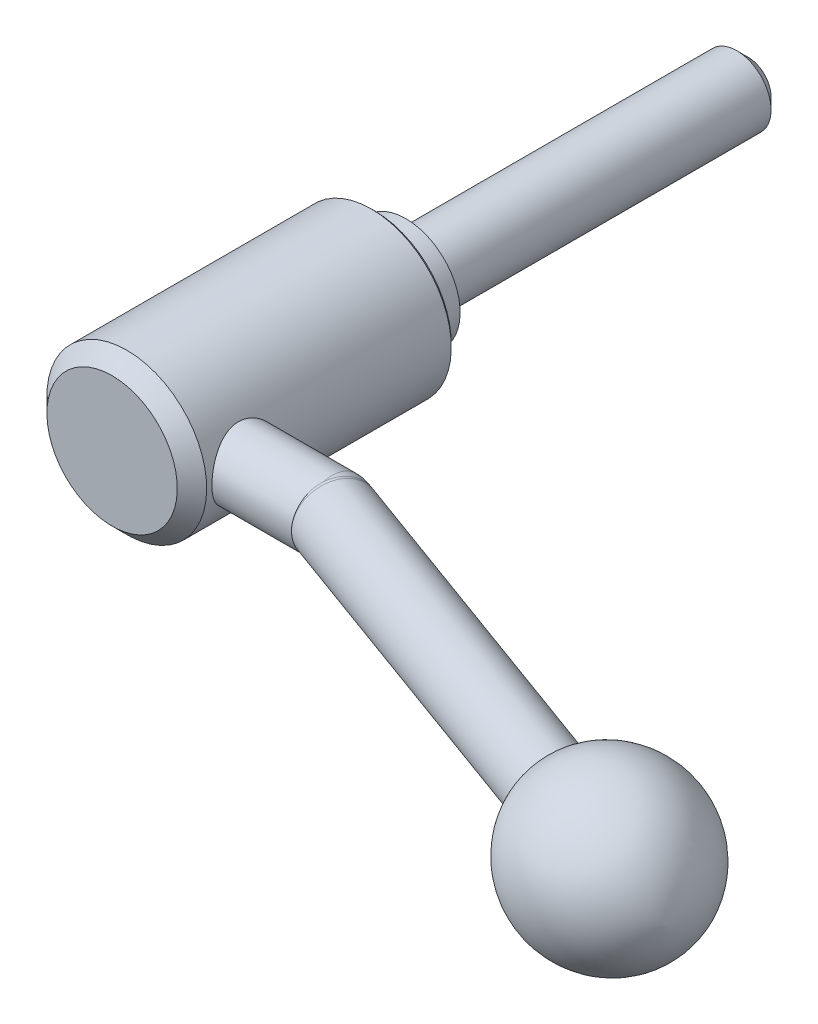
ISO-10303-21;
HEADER;
FILE_DESCRIPTION(('STEP AP214'),'2;1');
FILE_NAME('part.step','',(''),(''),'','','');
FILE_SCHEMA(('AUTOMOTIVE_DESIGN { 1 0 10303 214 1 1 1 1 }'));
ENDSEC;
DATA;
#1=APPLICATION_CONTEXT('core data for automotive mechanical design processes');
#2=APPLICATION_PROTOCOL_DEFINITION('international standard','automotive_design',2000,#1);
#3=PRODUCT_CONTEXT('',#1,'mechanical');
#4=PRODUCT('Part','Part','',(#3));
#5=PRODUCT_RELATED_PRODUCT_CATEGORY('part','',(#4));
#6=PRODUCT_DEFINITION_FORMATION('','',#4);
#7=PRODUCT_DEFINITION_CONTEXT('part definition',#1,'design');
#8=PRODUCT_DEFINITION('design','',#6,#7);
#9=PRODUCT_DEFINITION_SHAPE('','',#8);
#10=(LENGTH_UNIT() NAMED_UNIT(*) SI_UNIT(.MILLI.,.METRE.));
#11=(NAMED_UNIT(*) PLANE_ANGLE_UNIT() SI_UNIT($,.RADIAN.));
#12=(NAMED_UNIT(*) SI_UNIT($,.STERADIAN.) SOLID_ANGLE_UNIT());
#13=UNCERTAINTY_MEASURE_WITH_UNIT(LENGTH_MEASURE(1.E-05),#10,'distance_accuracy_value','');
#14=(GEOMETRIC_REPRESENTATION_CONTEXT(3) GLOBAL_UNCERTAINTY_ASSIGNED_CONTEXT((#13)) GLOBAL_UNIT_ASSIGNED_CONTEXT((#10,
#11,#12)) REPRESENTATION_CONTEXT('',''));
#15=CARTESIAN_POINT('',(0.,0.,0.));
#16=DIRECTION('',(0.,0.,1.));
#17=DIRECTION('',(1.,0.,0.));
#18=AXIS2_PLACEMENT_3D('',#15,#16,#17);
#19=CARTESIAN_POINT('',(0.,0.,0.));
#20=DIRECTION('',(0.,0.,-1.));
#21=DIRECTION('',(0.,1.,0.));
#22=AXIS2_PLACEMENT_3D('',#19,#20,#21);
#23=CYLINDRICAL_SURFACE('',#22,14.);
#24=CARTESIAN_POINT('',(0.,0.,6.05));
#25=DIRECTION('',(0.,0.,-1.));
#26=DIRECTION('',(0.,1.,0.));
#27=AXIS2_PLACEMENT_3D('',#24,#25,#26);
#28=CIRCLE('',#27,14.);
#29=CARTESIAN_POINT('',(0.,14.,6.05));
#30=VERTEX_POINT('',#29);
#31=EDGE_CURVE('E160',#30,#30,#28,.T.);
#32=ORIENTED_EDGE('',*,*,#31,.F.);
#33=EDGE_LOOP('',(#32));
#34=FACE_BOUND('',#33,.T.);
#35=CARTESIAN_POINT('',(12.6491106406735,6.,42.));
#36=CARTESIAN_POINT('',(12.6491119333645,5.99999879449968,42.1596004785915));
#37=CARTESIAN_POINT('',(12.6521417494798,5.99362272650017,42.319252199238));
#38=CARTESIAN_POINT('',(12.6641604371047,5.96818497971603,42.6373858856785));
#39=CARTESIAN_POINT('',(12.6731530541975,5.9491153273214,42.7958670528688));
#40=CARTESIAN_POINT('',(12.6968113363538,5.89845433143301,43.1107250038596));
#41=CARTESIAN_POINT('',(12.7114886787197,5.86683721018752,43.2670967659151));
#42=CARTESIAN_POINT('',(12.7460281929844,5.79141457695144,43.5763457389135));
#43=CARTESIAN_POINT('',(12.7658925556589,5.74760391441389,43.7292214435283));
#44=CARTESIAN_POINT('',(12.8100655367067,5.64846416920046,44.029718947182));
#45=CARTESIAN_POINT('',(12.834352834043,5.59319017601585,44.177362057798));
#46=CARTESIAN_POINT('',(12.8867070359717,5.47148691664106,44.467303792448));
#47=CARTESIAN_POINT('',(12.9147753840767,5.40505338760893,44.6096003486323));
#48=CARTESIAN_POINT('',(13.0034453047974,5.18984372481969,45.0271066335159));
#49=CARTESIAN_POINT('',(13.0685687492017,5.02503655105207,45.2932994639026));
#50=CARTESIAN_POINT('',(13.2082270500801,4.64606142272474,45.8109410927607));
#51=CARTESIAN_POINT('',(13.2830918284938,4.42953098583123,46.0605561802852));
#52=CARTESIAN_POINT('',(13.4311425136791,3.95794082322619,46.5214200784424));
#53=CARTESIAN_POINT('',(13.5043277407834,3.70286580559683,46.7326535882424));
#54=CARTESIAN_POINT('',(13.6088499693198,3.28949768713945,47.0208851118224));
#55=CARTESIAN_POINT('',(13.6435186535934,3.14296205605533,47.11390422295));
#56=CARTESIAN_POINT('',(13.7094062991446,2.84181000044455,47.2871776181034));
#57=CARTESIAN_POINT('',(13.7406265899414,2.68719672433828,47.3674368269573));
#58=CARTESIAN_POINT('',(13.798716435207,2.37092404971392,47.5144478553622));
#59=CARTESIAN_POINT('',(13.8255866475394,2.2092657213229,47.5812017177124));
#60=CARTESIAN_POINT('',(13.8741880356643,1.88004748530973,47.7005320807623));
#61=CARTESIAN_POINT('',(13.895919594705,1.71248801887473,47.7531096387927));
#62=CARTESIAN_POINT('',(13.9325503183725,1.38207962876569,47.8410157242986));
#63=CARTESIAN_POINT('',(13.9477579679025,1.21947370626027,47.8771298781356));
#64=CARTESIAN_POINT('',(13.9725603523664,0.891408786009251,47.9357518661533));
#65=CARTESIAN_POINT('',(13.9821554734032,0.725949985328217,47.9582606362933));
#66=CARTESIAN_POINT('',(13.9954554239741,0.393553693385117,47.9894048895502));
#67=CARTESIAN_POINT('',(13.9991623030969,0.226616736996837,47.9980452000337));
#68=CARTESIAN_POINT('',(14.0005839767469,-0.107418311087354,48.0013627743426));
#69=CARTESIAN_POINT('',(13.9982990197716,-0.274516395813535,47.996040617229));
#70=CARTESIAN_POINT('',(13.9881447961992,-0.596733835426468,47.9722942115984));
#71=CARTESIAN_POINT('',(13.9806457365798,-0.751929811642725,47.9547383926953));
#72=CARTESIAN_POINT('',(13.9606520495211,-1.06021754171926,47.9076442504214));
#73=CARTESIAN_POINT('',(13.9481558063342,-1.21330859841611,47.8781020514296));
#74=CARTESIAN_POINT('',(13.9184825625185,-1.51624558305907,47.807339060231));
#75=CARTESIAN_POINT('',(13.9013071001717,-1.66609256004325,47.7661221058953));
#76=CARTESIAN_POINT('',(13.8626834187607,-1.96169333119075,47.6723729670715));
#77=CARTESIAN_POINT('',(13.8412335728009,-2.10744554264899,47.6198364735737));
#78=CARTESIAN_POINT('',(13.7942200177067,-2.39607632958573,47.5030361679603));
#79=CARTESIAN_POINT('',(13.7685998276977,-2.53887984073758,47.4386094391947));
#80=CARTESIAN_POINT('',(13.7140859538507,-2.81854325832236,47.2990820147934));
#81=CARTESIAN_POINT('',(13.6851910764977,-2.9554009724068,47.2239774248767));
#82=CARTESIAN_POINT('',(13.5945766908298,-3.35592063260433,46.9834369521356));
#83=CARTESIAN_POINT('',(13.5288965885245,-3.60971063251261,46.8027004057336));
#84=CARTESIAN_POINT('',(13.3878711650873,-4.10313412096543,46.3903719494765));
#85=CARTESIAN_POINT('',(13.3121702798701,-4.34033236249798,46.1560074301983));
#86=CARTESIAN_POINT('',(13.1631451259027,-4.77326595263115,45.6505491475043));
#87=CARTESIAN_POINT('',(13.0898218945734,-4.96898340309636,45.3794396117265));
#88=CARTESIAN_POINT('',(12.9865629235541,-5.2305288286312,44.9447706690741));
#89=CARTESIAN_POINT('',(12.9527260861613,-5.31354333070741,44.7922272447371));
#90=CARTESIAN_POINT('',(12.8890027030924,-5.46630143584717,44.4798640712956));
#91=CARTESIAN_POINT('',(12.8591145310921,-5.53605050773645,44.3200473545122));
#92=CARTESIAN_POINT('',(12.8043472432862,-5.66157110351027,43.9942625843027));
#93=CARTESIAN_POINT('',(12.7794661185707,-5.7173482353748,43.8282970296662));
#94=CARTESIAN_POINT('',(12.7356345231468,-5.81433157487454,43.4913958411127));
#95=CARTESIAN_POINT('',(12.7166834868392,-5.85553917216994,43.3204606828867));
#96=CARTESIAN_POINT('',(12.6865220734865,-5.9205872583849,42.9866991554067));
#97=CARTESIAN_POINT('',(12.6748757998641,-5.94541170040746,42.824103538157));
#98=CARTESIAN_POINT('',(12.6578221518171,-5.98163380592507,42.4971025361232));
#99=CARTESIAN_POINT('',(12.6524143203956,-5.99303245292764,42.3326972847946));
#100=CARTESIAN_POINT('',(12.6480404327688,-6.00225784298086,42.0034733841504));
#101=CARTESIAN_POINT('',(12.6490723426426,-6.00008887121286,41.8386548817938));
#102=CARTESIAN_POINT('',(12.6575345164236,-5.98221680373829,41.5099230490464));
#103=CARTESIAN_POINT('',(12.6649645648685,-5.96651416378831,41.3460096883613));
#104=CARTESIAN_POINT('',(12.685211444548,-5.92333782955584,41.0317850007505));
#105=CARTESIAN_POINT('',(12.6976163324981,-5.89676170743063,40.8813224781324));
#106=CARTESIAN_POINT('',(12.7273370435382,-5.83233654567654,40.5832773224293));
#107=CARTESIAN_POINT('',(12.7446544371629,-5.79448390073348,40.435695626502));
#108=CARTESIAN_POINT('',(12.7836779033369,-5.70787446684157,40.1443991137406));
#109=CARTESIAN_POINT('',(12.8053831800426,-5.65911965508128,40.0006836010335));
#110=CARTESIAN_POINT('',(12.8525781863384,-5.55109972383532,39.7178468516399));
#111=CARTESIAN_POINT('',(12.8780693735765,-5.49183055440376,39.5787274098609));
#112=CARTESIAN_POINT('',(12.9333207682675,-5.36045709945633,39.2999549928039));
#113=CARTESIAN_POINT('',(12.9632176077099,-5.28790975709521,39.160537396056));
#114=CARTESIAN_POINT('',(13.0255703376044,-5.13240219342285,38.8882359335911));
#115=CARTESIAN_POINT('',(13.0580270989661,-5.04943842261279,38.7553543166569));
#116=CARTESIAN_POINT('',(13.1580121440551,-4.78560208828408,38.3674196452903));
#117=CARTESIAN_POINT('',(13.2281845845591,-4.58971750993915,38.1229353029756));
#118=CARTESIAN_POINT('',(13.3366249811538,-4.26021445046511,37.7715869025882));
#119=CARTESIAN_POINT('',(13.3748529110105,-4.13892354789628,37.6527973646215));
#120=CARTESIAN_POINT('',(13.4503551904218,-3.88654904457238,37.4257795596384));
#121=CARTESIAN_POINT('',(13.4876298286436,-3.75546845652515,37.3175480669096));
#122=CARTESIAN_POINT('',(13.5602429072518,-3.48418488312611,37.1123202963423));
#123=CARTESIAN_POINT('',(13.5955803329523,-3.34397719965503,37.0153298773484));
#124=CARTESIAN_POINT('',(13.6633349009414,-3.05536185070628,36.8333913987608));
#125=CARTESIAN_POINT('',(13.6957533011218,-2.90695776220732,36.7484381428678));
#126=CARTESIAN_POINT('',(13.7569620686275,-2.60198219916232,36.5908122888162));
#127=CARTESIAN_POINT('',(13.78573175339,-2.44537070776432,36.5182089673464));
#128=CARTESIAN_POINT('',(13.8386034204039,-2.12585519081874,36.3865716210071));
#129=CARTESIAN_POINT('',(13.862707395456,-1.96295388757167,36.3275318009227));
#130=CARTESIAN_POINT('',(13.9055467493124,-1.63205123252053,36.2236281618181));
#131=CARTESIAN_POINT('',(13.9242837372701,-1.46405142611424,36.1787600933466));
#132=CARTESIAN_POINT('',(13.9558282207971,-1.12426022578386,36.1037042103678));
#133=CARTESIAN_POINT('',(13.9686361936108,-0.952469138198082,36.0735152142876));
#134=CARTESIAN_POINT('',(13.9872197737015,-0.619242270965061,36.0298514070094));
#135=CARTESIAN_POINT('',(13.9934418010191,-0.457969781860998,36.0153142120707));
#136=CARTESIAN_POINT('',(14.0002858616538,-0.134661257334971,35.9993285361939));
#137=CARTESIAN_POINT('',(14.0009081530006,0.0273747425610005,35.99787945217));
#138=CARTESIAN_POINT('',(13.9965361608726,0.350926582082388,36.008085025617));
#139=CARTESIAN_POINT('',(13.991542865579,0.512442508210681,36.0197373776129));
#140=CARTESIAN_POINT('',(13.976077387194,0.833743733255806,36.0560107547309));
#141=CARTESIAN_POINT('',(13.9656052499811,0.993529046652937,36.0806316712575));
#142=CARTESIAN_POINT('',(13.9399800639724,1.30393627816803,36.1413509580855));
#143=CARTESIAN_POINT('',(13.9250277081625,1.45467118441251,36.176958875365));
#144=CARTESIAN_POINT('',(13.89068609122,1.75251852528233,36.2595669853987));
#145=CARTESIAN_POINT('',(13.8712953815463,1.89962975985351,36.3065708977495));
#146=CARTESIAN_POINT('',(13.8285434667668,2.18924878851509,36.4115377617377));
#147=CARTESIAN_POINT('',(13.8051831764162,2.33175763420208,36.4694981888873));
#148=CARTESIAN_POINT('',(13.7550167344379,2.61145800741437,36.5959410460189));
#149=CARTESIAN_POINT('',(13.7282092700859,2.74864748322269,36.6644274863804));
#150=CARTESIAN_POINT('',(13.6704759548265,3.02301487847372,36.8147378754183));
#151=CARTESIAN_POINT('',(13.639418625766,3.1599112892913,36.8970251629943));
#152=CARTESIAN_POINT('',(13.5749315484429,3.42637329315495,37.0719801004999));
#153=CARTESIAN_POINT('',(13.5415009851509,3.55593634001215,37.1646513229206));
#154=CARTESIAN_POINT('',(13.4730570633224,3.80705581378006,37.3597829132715));
#155=CARTESIAN_POINT('',(13.4380434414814,3.9286109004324,37.4622449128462));
#156=CARTESIAN_POINT('',(13.3672591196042,4.16309810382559,37.6763643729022));
#157=CARTESIAN_POINT('',(13.3314883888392,4.27602986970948,37.7880222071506));
#158=CARTESIAN_POINT('',(13.257431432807,4.50061025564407,38.02841367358));
#159=CARTESIAN_POINT('',(13.2191519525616,4.61156500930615,38.1577987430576));
#160=CARTESIAN_POINT('',(13.1437838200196,4.82218384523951,38.4257073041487));
#161=CARTESIAN_POINT('',(13.1066947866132,4.92185156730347,38.5642278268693));
#162=CARTESIAN_POINT('',(13.0347422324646,5.10936324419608,38.8498227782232));
#163=CARTESIAN_POINT('',(12.9998810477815,5.19719489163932,38.9969058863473));
#164=CARTESIAN_POINT('',(12.9335248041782,5.36019403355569,39.2985749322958));
#165=CARTESIAN_POINT('',(12.9020282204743,5.43536727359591,39.4531574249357));
#166=CARTESIAN_POINT('',(12.8434648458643,5.57233851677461,39.7687244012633));
#167=CARTESIAN_POINT('',(12.8163926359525,5.63415291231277,39.9297007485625));
#168=CARTESIAN_POINT('',(12.7676047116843,5.74385568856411,40.2570433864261));
#169=CARTESIAN_POINT('',(12.7458863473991,5.79175096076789,40.4234069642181));
#170=CARTESIAN_POINT('',(12.7086612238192,5.87298255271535,40.7598587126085));
#171=CARTESIAN_POINT('',(12.6931381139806,5.90635721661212,40.9299358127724));
#172=CARTESIAN_POINT('',(12.6688496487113,5.95827833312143,41.2727263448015));
#173=CARTESIAN_POINT('',(12.6600791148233,5.97683614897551,41.4454376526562));
#174=CARTESIAN_POINT('',(12.6529445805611,5.99191158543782,41.6821226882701));
#175=CARTESIAN_POINT('',(12.6515079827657,5.99494373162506,41.7456483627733));
#176=CARTESIAN_POINT('',(12.6495907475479,5.998988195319,41.8727799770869));
#177=CARTESIAN_POINT('',(12.6491101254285,6.00000048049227,41.936385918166));
#178=CARTESIAN_POINT('',(12.6491106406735,6.,42.));
#179=B_SPLINE_CURVE_WITH_KNOTS('',3,(#35,#36,#37,#38,#39,#40,#41,#42,#43,#44,#45,#46,#47,#48,
#49,#50,#51,#52,#53,#54,#55,#56,#57,#58,#59,#60,#61,#62,#63,#64,#65,#66,#67,#68,#69,#70,#71,#72,
#73,#74,#75,#76,#77,#78,#79,#80,#81,#82,#83,#84,#85,#86,#87,#88,#89,#90,#91,#92,#93,#94,#95,#96,
#97,#98,#99,#100,#101,#102,#103,#104,#105,#106,#107,#108,#109,#110,#111,#112,#113,#114,#115,
#116,#117,#118,#119,#120,#121,#122,#123,#124,#125,#126,#127,#128,#129,#130,#131,#132,#133,#134,
#135,#136,#137,#138,#139,#140,#141,#142,#143,#144,#145,#146,#147,#148,#149,#150,#151,#152,#153,
#154,#155,#156,#157,#158,#159,#160,#161,#162,#163,#164,#165,#166,#167,#168,#169,#170,#171,#172,
#173,#174,#175,#176,#177,#178),.UNSPECIFIED.,.T.,.F.,(4,2,2,2,2,2,2,2,2,2,2,2,2,2,2,2,2,2,2,2,2,
2,2,2,2,2,2,2,2,2,2,2,2,2,2,2,2,2,2,2,2,2,2,2,2,2,2,2,2,2,2,2,2,2,2,2,2,2,2,2,2,2,2,2,2,2,2,2,2,
2,2,4),(0.,0.478735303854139,0.957771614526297,1.43779720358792,1.91802586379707,
2.39599804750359,2.87415322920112,3.82930565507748,4.84157827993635,5.85425356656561,
6.38467511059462,6.91489143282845,7.44502749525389,7.97512400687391,8.47625092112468,
8.9773433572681,9.47826133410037,9.97915853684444,10.4477041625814,10.9164014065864,
11.3849447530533,11.8536667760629,12.3293655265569,12.8052382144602,13.756394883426,
14.7778987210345,15.7998424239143,16.330075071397,16.8600886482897,17.3898891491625,
17.9196391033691,18.4136567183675,18.9076381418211,19.4014635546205,19.8952723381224,
20.354632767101,20.814140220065,21.2735644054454,21.7331659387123,22.2125740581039,
22.6921459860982,23.6508169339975,24.1724207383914,24.6938646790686,25.2155791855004,
25.7370677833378,26.2613915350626,26.7854908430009,27.3094328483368,27.8333326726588,
28.3188546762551,28.8043543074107,29.2897685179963,29.7751786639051,30.2414628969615,
30.7078995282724,31.1742288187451,31.6407362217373,32.1283561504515,32.6161443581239,
33.1040139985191,33.5919034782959,34.1153644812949,34.6386561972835,35.1624879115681,
35.6860812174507,36.2090283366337,36.7317160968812,37.253015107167,37.7739139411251,
37.9647267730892,38.1555426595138),.UNSPECIFIED.);
#180=CARTESIAN_POINT('',(12.6491106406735,6.,42.));
#181=VERTEX_POINT('',#180);
#182=EDGE_CURVE('E79',#181,#181,#179,.T.);
#183=ORIENTED_EDGE('',*,*,#182,.F.);
#184=EDGE_LOOP('',(#183));
#185=FACE_BOUND('',#184,.T.);
#186=CARTESIAN_POINT('',(0.,0.,48.925));
#187=DIRECTION('',(0.,0.,-1.));
#188=DIRECTION('',(0.,1.,0.));
#189=AXIS2_PLACEMENT_3D('',#186,#187,#188);
#190=CIRCLE('',#189,14.);
#191=CARTESIAN_POINT('',(0.,14.,48.925));
#192=VERTEX_POINT('',#191);
#193=EDGE_CURVE('E163',#192,#192,#190,.T.);
#194=ORIENTED_EDGE('',*,*,#193,.T.);
#195=EDGE_LOOP('',(#194));
#196=FACE_BOUND('',#195,.T.);
#197=ADVANCED_FACE('F15',(#34,#185,#196),#23,.T.);
#198=CARTESIAN_POINT('',(0.,0.,51.5));
#199=DIRECTION('',(0.,0.,-1.));
#200=DIRECTION('',(0.,1.,0.));
#201=AXIS2_PLACEMENT_3D('',#198,#199,#200);
#202=PLANE('',#201);
#203=CARTESIAN_POINT('',(0.,0.,51.5));
#204=DIRECTION('',(0.,0.,-1.));
#205=DIRECTION('',(0.,1.,0.));
#206=AXIS2_PLACEMENT_3D('',#203,#204,#205);
#207=CIRCLE('',#206,11.425);
#208=CARTESIAN_POINT('',(0.,11.425,51.5));
#209=VERTEX_POINT('',#208);
#210=EDGE_CURVE('E88',#209,#209,#207,.T.);
#211=ORIENTED_EDGE('',*,*,#210,.F.);
#212=EDGE_LOOP('',(#211));
#213=FACE_BOUND('',#212,.T.);
#214=ADVANCED_FACE('F63',(#213),#202,.F.);
#215=CARTESIAN_POINT('',(0.,0.,51.5));
#216=DIRECTION('',(0.,0.,-1.));
#217=DIRECTION('',(0.,1.,0.));
#218=AXIS2_PLACEMENT_3D('',#215,#216,#217);
#219=CONICAL_SURFACE('',#218,11.425,0.785398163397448);
#220=ORIENTED_EDGE('',*,*,#193,.F.);
#221=EDGE_LOOP('',(#220));
#222=FACE_BOUND('',#221,.T.);
#223=ORIENTED_EDGE('',*,*,#210,.T.);
#224=EDGE_LOOP('',(#223));
#225=FACE_BOUND('',#224,.T.);
#226=ADVANCED_FACE('F69',(#222,#225),#219,.T.);
#227=CARTESIAN_POINT('',(0.,0.,6.05));
#228=DIRECTION('',(0.,0.,1.));
#229=DIRECTION('',(0.,-1.,0.));
#230=AXIS2_PLACEMENT_3D('',#227,#228,#229);
#231=CONICAL_SURFACE('',#230,14.,0.785398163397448);
#232=CARTESIAN_POINT('',(0.,0.,5.5));
#233=DIRECTION('',(0.,0.,-1.));
#234=DIRECTION('',(0.,1.,0.));
#235=AXIS2_PLACEMENT_3D('',#232,#233,#234);
#236=CIRCLE('',#235,13.45);
#237=CARTESIAN_POINT('',(0.,13.45,5.5));
#238=VERTEX_POINT('',#237);
#239=EDGE_CURVE('E154',#238,#238,#236,.T.);
#240=ORIENTED_EDGE('',*,*,#239,.F.);
#241=EDGE_LOOP('',(#240));
#242=FACE_BOUND('',#241,.T.);
#243=ORIENTED_EDGE('',*,*,#31,.T.);
#244=EDGE_LOOP('',(#243));
#245=FACE_BOUND('',#244,.T.);
#246=ADVANCED_FACE('F76',(#242,#245),#231,.T.);
#247=CARTESIAN_POINT('',(13.45,0.,5.5));
#248=DIRECTION('',(0.,0.,1.));
#249=DIRECTION('',(0.,-1.,0.));
#250=AXIS2_PLACEMENT_3D('',#247,#248,#249);
#251=PLANE('',#250);
#252=CARTESIAN_POINT('',(0.,0.,5.5));
#253=DIRECTION('',(0.,0.,-1.));
#254=DIRECTION('',(0.,1.,0.));
#255=AXIS2_PLACEMENT_3D('',#252,#253,#254);
#256=CIRCLE('',#255,9.5);
#257=CARTESIAN_POINT('',(0.,9.5,5.5));
#258=VERTEX_POINT('',#257);
#259=EDGE_CURVE('E150',#258,#258,#256,.T.);
#260=ORIENTED_EDGE('',*,*,#259,.F.);
#261=EDGE_LOOP('',(#260));
#262=FACE_BOUND('',#261,.T.);
#263=ORIENTED_EDGE('',*,*,#239,.T.);
#264=EDGE_LOOP('',(#263));
#265=FACE_BOUND('',#264,.T.);
#266=ADVANCED_FACE('F177',(#262,#265),#251,.F.);
#267=CARTESIAN_POINT('',(0.,0.,0.));
#268=DIRECTION('',(0.,0.,-1.));
#269=DIRECTION('',(0.,1.,0.));
#270=AXIS2_PLACEMENT_3D('',#267,#268,#269);
#271=CYLINDRICAL_SURFACE('',#270,9.5);
#272=CARTESIAN_POINT('',(0.,0.,0.));
#273=DIRECTION('',(0.,0.,-1.));
#274=DIRECTION('',(0.,1.,0.));
#275=AXIS2_PLACEMENT_3D('',#272,#273,#274);
#276=CIRCLE('',#275,9.5);
#277=CARTESIAN_POINT('',(0.,9.5,0.));
#278=VERTEX_POINT('',#277);
#279=EDGE_CURVE('E147',#278,#278,#276,.T.);
#280=ORIENTED_EDGE('',*,*,#279,.F.);
#281=EDGE_LOOP('',(#280));
#282=FACE_BOUND('',#281,.T.);
#283=ORIENTED_EDGE('',*,*,#259,.T.);
#284=EDGE_LOOP('',(#283));
#285=FACE_BOUND('',#284,.T.);
#286=ADVANCED_FACE('F144',(#282,#285),#271,.T.);
#287=CARTESIAN_POINT('',(9.5,0.,0.));
#288=DIRECTION('',(0.,0.,1.));
#289=DIRECTION('',(0.,-1.,0.));
#290=AXIS2_PLACEMENT_3D('',#287,#288,#289);
#291=PLANE('',#290);
#292=CARTESIAN_POINT('',(0.,0.,0.));
#293=DIRECTION('',(0.,0.,-1.));
#294=DIRECTION('',(0.,1.,0.));
#295=AXIS2_PLACEMENT_3D('',#292,#293,#294);
#296=CIRCLE('',#295,6.);
#297=CARTESIAN_POINT('',(0.,6.,0.));
#298=VERTEX_POINT('',#297);
#299=EDGE_CURVE('E134',#298,#298,#296,.T.);
#300=ORIENTED_EDGE('',*,*,#299,.F.);
#301=EDGE_LOOP('',(#300));
#302=FACE_BOUND('',#301,.T.);
#303=ORIENTED_EDGE('',*,*,#279,.T.);
#304=EDGE_LOOP('',(#303));
#305=FACE_BOUND('',#304,.T.);
#306=ADVANCED_FACE('F96',(#302,#305),#291,.F.);
#307=CARTESIAN_POINT('',(35.,0.,42.));
#308=DIRECTION('',(1.,0.,0.));
#309=DIRECTION('',(0.,1.,0.));
#310=AXIS2_PLACEMENT_3D('',#307,#308,#309);
#311=CYLINDRICAL_SURFACE('',#310,6.);
#312=CARTESIAN_POINT('',(29.0002,-5.79737991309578,43.546087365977));
#313=CARTESIAN_POINT('',(28.9724990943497,-5.77707543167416,43.6222362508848));
#314=CARTESIAN_POINT('',(28.9459271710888,-5.75516638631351,43.6983487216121));
#315=CARTESIAN_POINT('',(28.894739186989,-5.70814835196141,43.8502306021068));
#316=CARTESIAN_POINT('',(28.8701228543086,-5.68303980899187,43.9260000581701));
#317=CARTESIAN_POINT('',(28.7987695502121,-5.6029491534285,44.1523368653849));
#318=CARTESIAN_POINT('',(28.7544982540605,-5.54317949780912,44.3020176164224));
#319=CARTESIAN_POINT('',(28.6711793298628,-5.41121602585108,44.5970862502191));
#320=CARTESIAN_POINT('',(28.6321268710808,-5.3390338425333,44.7424780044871));
#321=CARTESIAN_POINT('',(28.5583361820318,-5.18257721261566,45.0277646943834));
#322=CARTESIAN_POINT('',(28.5235982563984,-5.09830191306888,45.1676592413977));
#323=CARTESIAN_POINT('',(28.4579073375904,-4.91822874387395,45.4406017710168));
#324=CARTESIAN_POINT('',(28.4269515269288,-4.82243955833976,45.5736548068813));
#325=CARTESIAN_POINT('',(28.3684157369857,-4.61988344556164,45.8319198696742));
#326=CARTESIAN_POINT('',(28.3408357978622,-4.5131163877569,45.9571318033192));
#327=CARTESIAN_POINT('',(28.2887910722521,-4.28931411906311,46.1986769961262));
#328=CARTESIAN_POINT('',(28.264325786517,-4.17228055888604,46.3150116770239));
#329=CARTESIAN_POINT('',(28.2183149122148,-3.92870690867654,46.537897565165));
#330=CARTESIAN_POINT('',(28.1967693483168,-3.8021667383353,46.6444486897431));
#331=CARTESIAN_POINT('',(28.1562496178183,-3.53907309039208,46.8479799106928));
#332=CARTESIAN_POINT('',(28.1373045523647,-3.40242909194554,46.944848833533));
#333=CARTESIAN_POINT('',(28.1021430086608,-3.12121919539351,47.1269937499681));
#334=CARTESIAN_POINT('',(28.0859274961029,-2.97665051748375,47.212265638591));
#335=CARTESIAN_POINT('',(28.0561585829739,-2.68068805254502,47.3704807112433));
#336=CARTESIAN_POINT('',(28.0426047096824,-2.52929548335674,47.4434260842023));
#337=CARTESIAN_POINT('',(28.0180943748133,-2.2206886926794,47.5764491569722));
#338=CARTESIAN_POINT('',(28.0071388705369,-2.063472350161,47.6365221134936));
#339=CARTESIAN_POINT('',(27.987872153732,-1.74574860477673,47.7428380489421));
#340=CARTESIAN_POINT('',(27.97953948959,-1.5852799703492,47.7891930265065));
#341=CARTESIAN_POINT('',(27.965363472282,-1.26087148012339,47.8683977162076));
#342=CARTESIAN_POINT('',(27.9595210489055,-1.09693035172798,47.9012423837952));
#343=CARTESIAN_POINT('',(27.950314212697,-0.766902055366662,47.9531293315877));
#344=CARTESIAN_POINT('',(27.9469484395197,-0.600816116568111,47.972179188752));
#345=CARTESIAN_POINT('',(27.9426785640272,-0.267526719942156,47.9963621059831));
#346=CARTESIAN_POINT('',(27.9417755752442,-0.100322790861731,48.0014888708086));
#347=CARTESIAN_POINT('',(27.9424301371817,0.233076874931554,47.9977768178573));
#348=CARTESIAN_POINT('',(27.943975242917,0.399273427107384,47.9890086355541));
#349=CARTESIAN_POINT('',(27.9495060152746,0.730248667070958,47.9577139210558));
#350=CARTESIAN_POINT('',(27.9534905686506,0.895027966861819,47.9351936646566));
#351=CARTESIAN_POINT('',(27.9639138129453,1.22215531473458,47.8765604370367));
#352=CARTESIAN_POINT('',(27.9703537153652,1.38450212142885,47.8404407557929));
#353=CARTESIAN_POINT('',(27.9857050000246,1.70547020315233,47.7549062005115));
#354=CARTESIAN_POINT('',(27.9946154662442,1.86409283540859,47.7054962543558));
#355=CARTESIAN_POINT('',(28.0149428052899,2.17661167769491,47.5937385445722));
#356=CARTESIAN_POINT('',(28.0263605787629,2.33050616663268,47.5313861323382));
#357=CARTESIAN_POINT('',(28.0517386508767,2.63237333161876,47.3942638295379));
#358=CARTESIAN_POINT('',(28.0656980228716,2.78034814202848,47.3194984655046));
#359=CARTESIAN_POINT('',(28.0962237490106,3.06943625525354,47.1580977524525));
#360=CARTESIAN_POINT('',(28.1127906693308,3.21054805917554,47.0714598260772));
#361=CARTESIAN_POINT('',(28.1486024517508,3.48485557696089,46.8870325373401));
#362=CARTESIAN_POINT('',(28.1678464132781,3.61805393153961,46.789246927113));
#363=CARTESIAN_POINT('',(28.2092310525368,3.87634885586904,46.5827287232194));
#364=CARTESIAN_POINT('',(28.2313862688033,4.00139970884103,46.4739418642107));
#365=CARTESIAN_POINT('',(28.2786635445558,4.24179144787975,46.2467117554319));
#366=CARTESIAN_POINT('',(28.303785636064,4.35713222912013,46.128268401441));
#367=CARTESIAN_POINT('',(28.3572036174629,4.57734862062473,45.8826648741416));
#368=CARTESIAN_POINT('',(28.38549985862,4.68222307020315,45.7555037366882));
#369=CARTESIAN_POINT('',(28.445549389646,4.88081288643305,45.4935198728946));
#370=CARTESIAN_POINT('',(28.4773025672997,4.97452861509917,45.3586973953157));
#371=CARTESIAN_POINT('',(28.5429262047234,5.14565563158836,45.0897088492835));
#372=CARTESIAN_POINT('',(28.5766009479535,5.22366104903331,44.9558726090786));
#373=CARTESIAN_POINT('',(28.647938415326,5.36870734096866,44.6834298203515));
#374=CARTESIAN_POINT('',(28.6856006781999,5.43574948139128,44.5448238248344));
#375=CARTESIAN_POINT('',(28.7657142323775,5.55859867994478,44.2639502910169));
#376=CARTESIAN_POINT('',(28.8081677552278,5.61440046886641,44.1216810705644));
#377=CARTESIAN_POINT('',(28.8763731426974,5.68948565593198,43.9067054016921));
#378=CARTESIAN_POINT('',(28.8998696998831,5.7130832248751,43.8347644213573));
#379=CARTESIAN_POINT('',(28.9486375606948,5.7573957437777,43.6905883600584));
#380=CARTESIAN_POINT('',(28.9739090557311,5.77811038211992,43.6183532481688));
#381=CARTESIAN_POINT('',(29.0001999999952,5.79737991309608,43.546087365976));
#382=B_SPLINE_CURVE_WITH_KNOTS('',3,(#312,#313,#314,#315,#316,#317,#318,#319,#320,#321,#322,
#323,#324,#325,#326,#327,#328,#329,#330,#331,#332,#333,#334,#335,#336,#337,#338,#339,#340,#341,
#342,#343,#344,#345,#346,#347,#348,#349,#350,#351,#352,#353,#354,#355,#356,#357,#358,#359,#360,
#361,#362,#363,#364,#365,#366,#367,#368,#369,#370,#371,#372,#373,#374,#375,#376,#377,#378,#379,
#380,#381),.UNSPECIFIED.,.F.,.F.,(4,2,2,2,2,2,2,2,2,2,2,2,2,2,2,2,2,2,2,2,2,2,2,2,2,2,2,2,2,2,2,
2,2,2,4),(0.,0.250554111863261,0.501073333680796,1.00183412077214,1.50212812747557,
2.0024574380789,2.50241172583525,3.00237196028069,3.50225195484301,4.00213617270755,
4.50722386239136,5.01248987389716,5.51766606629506,6.02302808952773,6.52414248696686,
7.02544382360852,7.52646960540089,8.02772188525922,8.52643419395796,9.02491908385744,
9.52365025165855,10.0221967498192,10.5209226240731,11.0194670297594,11.5181198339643,
12.0166052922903,12.5176821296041,13.0187643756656,13.5199021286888,14.0210236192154,
14.4961092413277,14.9711399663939,15.4463928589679,15.684153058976,15.9219389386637),.UNSPECIFIED.);
#383=CARTESIAN_POINT('',(29.,-5.79723335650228,43.5466368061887));
#384=VERTEX_POINT('',#383);
#385=CARTESIAN_POINT('',(27.9420381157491,0.,48.));
#386=VERTEX_POINT('',#385);
#387=EDGE_CURVE('E31',#384,#386,#382,.T.);
#388=ORIENTED_EDGE('',*,*,#387,.T.);
#389=CARTESIAN_POINT('',(29.,5.79723335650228,43.5466368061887));
#390=VERTEX_POINT('',#389);
#391=EDGE_CURVE('E101',#386,#390,#382,.T.);
#392=ORIENTED_EDGE('',*,*,#391,.T.);
#393=CARTESIAN_POINT('',(29.,0.,42.));
#394=DIRECTION('',(1.,0.,0.));
#395=DIRECTION('',(0.,1.,0.));
#396=AXIS2_PLACEMENT_3D('',#393,#394,#395);
#397=CIRCLE('',#396,6.);
#398=EDGE_CURVE('E111',#384,#390,#397,.T.);
#399=ORIENTED_EDGE('',*,*,#398,.F.);
#400=EDGE_LOOP('',(#388,#392,#399));
#401=FACE_BOUND('',#400,.T.);
#402=ORIENTED_EDGE('',*,*,#182,.T.);
#403=EDGE_LOOP('',(#402));
#404=FACE_BOUND('',#403,.T.);
#405=ADVANCED_FACE('F90',(#401,#404),#311,.T.);
#406=CARTESIAN_POINT('',(29.,0.,42.));
#407=DIRECTION('',(1.,0.,0.));
#408=DIRECTION('',(0.,0.,1.));
#409=AXIS2_PLACEMENT_3D('',#406,#407,#408);
#410=SPHERICAL_SURFACE('',#409,6.);
#411=CARTESIAN_POINT('',(29.4970794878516,0.,42.1809221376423));
#412=DIRECTION('',(0.939692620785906,0.,0.342020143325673));
#413=DIRECTION('',(-0.342020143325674,0.,0.939692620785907));
#414=AXIS2_PLACEMENT_3D('',#411,#412,#413);
#415=CIRCLE('',#414,5.97663610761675);
#416=EDGE_CURVE('E38',#384,#390,#415,.T.);
#417=ORIENTED_EDGE('',*,*,#416,.F.);
#418=ORIENTED_EDGE('',*,*,#398,.T.);
#419=EDGE_LOOP('',(#417,#418));
#420=FACE_BOUND('',#419,.T.);
#421=ADVANCED_FACE('F95',(#420),#410,.T.);
#422=CARTESIAN_POINT('',(29.9941589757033,0.,42.3618442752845));
#423=DIRECTION('',(0.939692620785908,0.,0.342020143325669));
#424=DIRECTION('',(-0.342020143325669,0.,0.939692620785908));
#425=AXIS2_PLACEMENT_3D('',#422,#423,#424);
#426=SPHERICAL_SURFACE('',#425,6.);
#427=ORIENTED_EDGE('',*,*,#387,.F.);
#428=ORIENTED_EDGE('',*,*,#416,.T.);
#429=ORIENTED_EDGE('',*,*,#391,.F.);
#430=CARTESIAN_POINT('',(29.9941589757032,0.,42.3618442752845));
#431=DIRECTION('',(0.939692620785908,0.,0.342020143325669));
#432=DIRECTION('',(-0.342020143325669,0.,0.939692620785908));
#433=AXIS2_PLACEMENT_3D('',#430,#431,#432);
#434=CIRCLE('',#433,6.);
#435=EDGE_CURVE('E109',#386,#386,#434,.T.);
#436=ORIENTED_EDGE('',*,*,#435,.F.);
#437=EDGE_LOOP('',(#427,#428,#429,#436));
#438=FACE_BOUND('',#437,.T.);
#439=ADVANCED_FACE('F113',(#438),#426,.T.);
#440=CARTESIAN_POINT('',(120.484247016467,0.,75.2975428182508));
#441=DIRECTION('',(0.939692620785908,0.,0.342020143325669));
#442=DIRECTION('',(-0.342020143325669,0.,0.939692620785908));
#443=AXIS2_PLACEMENT_3D('',#440,#441,#442);
#444=CYLINDRICAL_SURFACE('',#443,6.);
#445=CARTESIAN_POINT('',(93.4815813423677,0.,65.4693762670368));
#446=DIRECTION('',(0.939692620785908,0.,0.342020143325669));
#447=DIRECTION('',(-0.342020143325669,0.,0.939692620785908));
#448=AXIS2_PLACEMENT_3D('',#445,#446,#447);
#449=CIRCLE('',#448,6.);
#450=CARTESIAN_POINT('',(91.4294604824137,0.,71.1075319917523));
#451=VERTEX_POINT('',#450);
#452=EDGE_CURVE('E125',#451,#451,#449,.T.);
#453=ORIENTED_EDGE('',*,*,#452,.F.);
#454=EDGE_LOOP('',(#453));
#455=FACE_BOUND('',#454,.T.);
#456=ORIENTED_EDGE('',*,*,#435,.T.);
#457=EDGE_LOOP('',(#456));
#458=FACE_BOUND('',#457,.T.);
#459=ADVANCED_FACE('F58',(#455,#458),#444,.T.);
#460=CARTESIAN_POINT('',(91.4294604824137,0.,71.1075319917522));
#461=DIRECTION('',(0.939692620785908,0.,0.342020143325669));
#462=DIRECTION('',(-0.342020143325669,0.,0.939692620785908));
#463=AXIS2_PLACEMENT_3D('',#460,#461,#462);
#464=PLANE('',#463);
#465=CARTESIAN_POINT('',(93.4815813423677,0.,65.4693762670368));
#466=DIRECTION('',(0.939692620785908,0.,0.342020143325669));
#467=DIRECTION('',(-0.342020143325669,0.,0.939692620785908));
#468=AXIS2_PLACEMENT_3D('',#465,#466,#467);
#469=CIRCLE('',#468,8.16630341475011);
#470=CARTESIAN_POINT('',(90.688541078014,0.,73.1431913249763));
#471=VERTEX_POINT('',#470);
#472=EDGE_CURVE('E131',#471,#471,#469,.T.);
#473=ORIENTED_EDGE('',*,*,#472,.F.);
#474=EDGE_LOOP('',(#473));
#475=FACE_BOUND('',#474,.T.);
#476=ORIENTED_EDGE('',*,*,#452,.T.);
#477=EDGE_LOOP('',(#476));
#478=FACE_BOUND('',#477,.T.);
#479=ADVANCED_FACE('F47',(#475,#478),#464,.F.);
#480=CARTESIAN_POINT('',(106.,0.,68.5));
#481=DIRECTION('',(0.,0.999999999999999,0.));
#482=DIRECTION('',(-0.342020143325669,0.,0.939692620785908));
#483=AXIS2_PLACEMENT_3D('',#480,#481,#482);
#484=CIRCLE('',#483,16.);
#485=TRIMMED_CURVE('',#484,(PARAMETER_VALUE(-1.48106994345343)),
(PARAMETER_VALUE(1.48106994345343)),.T.,.PARAMETER.);
#486=CARTESIAN_POINT('',(105.509646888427,0.,69.8472341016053));
#487=DIRECTION('',(0.939692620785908,0.,0.342020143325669));
#488=AXIS1_PLACEMENT('',#486,#487);
#489=SURFACE_OF_REVOLUTION('',#485,#488);
#490=ORIENTED_EDGE('',*,*,#472,.T.);
#491=EDGE_LOOP('',(#490));
#492=FACE_BOUND('',#491,.T.);
#493=CARTESIAN_POINT('',(120.484247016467,0.,75.2975428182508));
#494=VERTEX_POINT('',#493);
#495=VERTEX_LOOP('',#494);
#496=FACE_BOUND('',#495,.T.);
#497=ADVANCED_FACE('F44',(#492,#496),#489,.T.);
#498=CARTESIAN_POINT('',(0.,0.,17.));
#499=DIRECTION('',(0.,0.,-1.));
#500=DIRECTION('',(-1.,0.,0.));
#501=AXIS2_PLACEMENT_3D('',#498,#499,#500);
#502=CYLINDRICAL_SURFACE('',#501,6.);
#503=CARTESIAN_POINT('',(0.,0.,-58.));
#504=DIRECTION('',(0.,0.,-1.));
#505=DIRECTION('',(-1.,0.,0.));
#506=AXIS2_PLACEMENT_3D('',#503,#504,#505);
#507=CIRCLE('',#506,6.);
#508=CARTESIAN_POINT('',(-6.,0.,-58.));
#509=VERTEX_POINT('',#508);
#510=EDGE_CURVE('E9',#509,#509,#507,.F.);
#511=ORIENTED_EDGE('',*,*,#510,.T.);
#512=EDGE_LOOP('',(#511));
#513=FACE_BOUND('',#512,.T.);
#514=ORIENTED_EDGE('',*,*,#299,.T.);
#515=EDGE_LOOP('',(#514));
#516=FACE_BOUND('',#515,.T.);
#517=ADVANCED_FACE('F46',(#513,#516),#502,.T.);
#518=CARTESIAN_POINT('',(0.,0.,-60.));
#519=DIRECTION('',(0.,0.,-1.));
#520=DIRECTION('',(-1.,0.,0.));
#521=AXIS2_PLACEMENT_3D('',#518,#519,#520);
#522=PLANE('',#521);
#523=CARTESIAN_POINT('',(0.,0.,-60.));
#524=DIRECTION('',(0.,0.,-1.));
#525=DIRECTION('',(-1.,0.,0.));
#526=AXIS2_PLACEMENT_3D('',#523,#524,#525);
#527=CIRCLE('',#526,4.);
#528=CARTESIAN_POINT('',(-4.,0.,-60.));
#529=VERTEX_POINT('',#528);
#530=EDGE_CURVE('E24',#529,#529,#527,.T.);
#531=ORIENTED_EDGE('',*,*,#530,.T.);
#532=EDGE_LOOP('',(#531));
#533=FACE_BOUND('',#532,.T.);
#534=ADVANCED_FACE('F55',(#533),#522,.T.);
#535=CARTESIAN_POINT('',(0.,0.,-60.));
#536=DIRECTION('',(0.,0.,1.));
#537=DIRECTION('',(1.,0.,0.));
#538=AXIS2_PLACEMENT_3D('',#535,#536,#537);
#539=CONICAL_SURFACE('',#538,4.,0.785398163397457);
#540=ORIENTED_EDGE('',*,*,#510,.F.);
#541=EDGE_LOOP('',(#540));
#542=FACE_BOUND('',#541,.T.);
#543=ORIENTED_EDGE('',*,*,#530,.F.);
#544=EDGE_LOOP('',(#543));
#545=FACE_BOUND('',#544,.T.);
#546=ADVANCED_FACE('F17',(#542,#545),#539,.T.);
#547=CLOSED_SHELL('',(#197,#214,#226,#246,#266,#286,#306,#405,#421,#439,#459,#479,#497,#517,
#534,#546));
#548=MANIFOLD_SOLID_BREP('B1',#547);
#549=ADVANCED_BREP_SHAPE_REPRESENTATION('',(#18,#548),#14);
#550=SHAPE_DEFINITION_REPRESENTATION(#9,#549);
ENDSEC;
END-ISO-10303-21;
